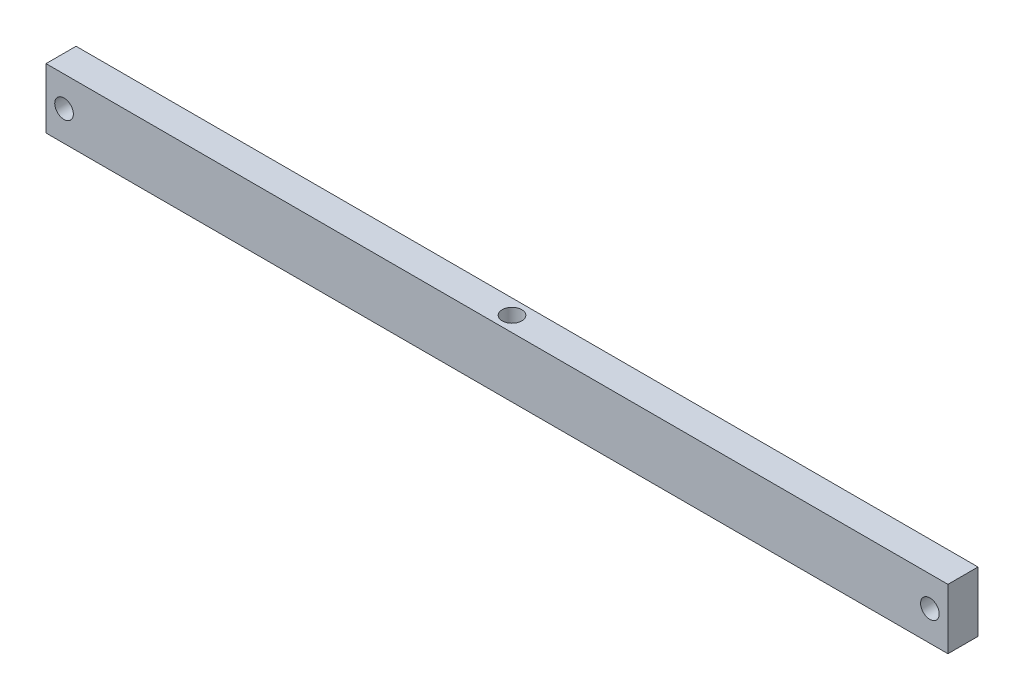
from build123d import *

# Parameters (mm, degrees)
ESQUISSE1_W             = 300
ESQUISSE1_H             = 20
ESQUISSE1_R             = 3.1
EXTRUSION1_DEPTH        = 5
ENL_V_MAT_EXTRU_1_REACH = 302.707
ESQUISSE2_R             = 3.25


with BuildPart() as part:
    # Esquisse1 → Extrusion1 (new, symmetric)
    with BuildSketch(Plane.XY):
        with Locations((150, 10)):
            Rectangle(ESQUISSE1_W, ESQUISSE1_H)
        with Locations((6, 10)):
            Circle(ESQUISSE1_R, mode=Mode.SUBTRACT)
        with Locations(Location((294, 10, 0), (0, 0, 180))):
            Circle(ESQUISSE1_R, mode=Mode.SUBTRACT)
    extrude(amount=EXTRUSION1_DEPTH, both=True)

    # Esquisse2 → Enl_v. mat.-Extru.1 (cut, up to next)
    with BuildSketch(Plane(origin=(0, 20, 0), x_dir=(-1, 0, 0), z_dir=(0, 1, 0)), mode=Mode.PRIVATE) as enl_v_mat_extru_1_sk1:
        with Locations(Location((-150, 0, 0), (0, 0, 90))):
            Circle(ESQUISSE2_R)
    enl_v_mat_extru_1_tool1 = extrude(enl_v_mat_extru_1_sk1.sketch, amount=-ENL_V_MAT_EXTRU_1_REACH, mode=Mode.PRIVATE) & part.part
    add(enl_v_mat_extru_1_tool1.solids().sort_by_distance((150, 20, 0))[0], mode=Mode.SUBTRACT)


solid = part.part
